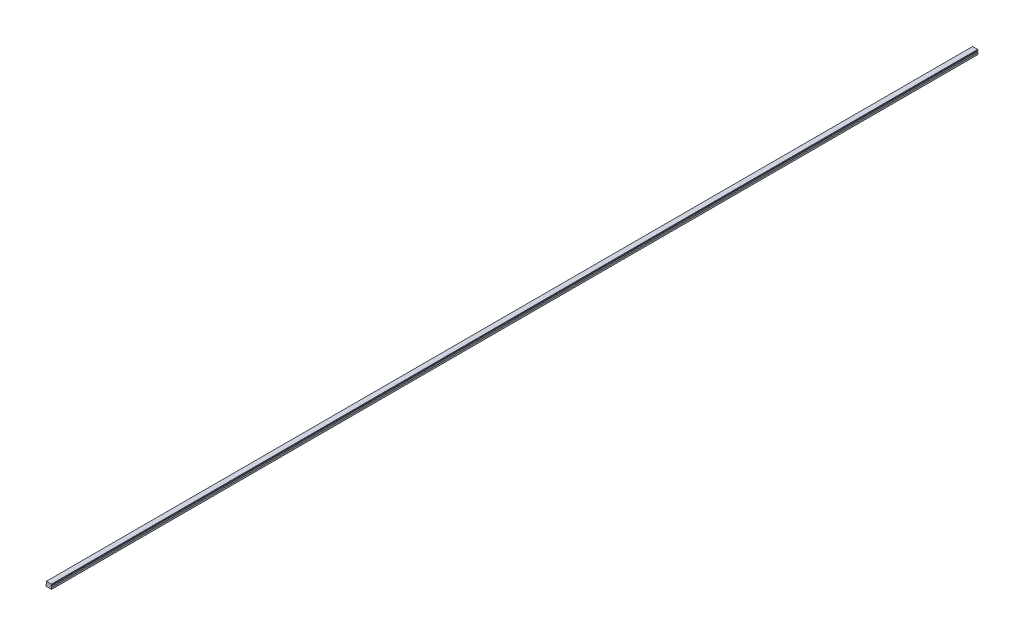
from build123d import *

# Parameters (mm, degrees)
SKETCH1_W           = 20
SKETCH1_H           = 16.3
BOSS_EXTRUDE1_DEPTH = 1640
CUT_EXTRUDE1_DEPTH  = 3281.055744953
CHAMFER1_SIZE       = 1
FILLET1_R           = 1
CUT_EXTRUDE2_DEPTH  = 3281.055744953
SKETCH5_R           = 3
SKETCH5_R_2         = 2.5
CUT_EXTRUDE5_DEPTH  = 10
SKETCH5_2_R         = 2.5
CUT_EXTRUDE6_DEPTH  = 13
LPATTERN2_COUNT     = 55
LPATTERN2_PITCH     = 60


with BuildPart() as part:
    # Sketch1 → Boss-Extrude1 (new, symmetric)
    with BuildSketch(Plane.XY):
        with Locations((0, 8.15)):
            Rectangle(SKETCH1_W, SKETCH1_H)
    extrude(amount=BOSS_EXTRUDE1_DEPTH, both=True)

    # Sketch2 → Cut-Extrude1 (cut, through all)
    with BuildSketch(Plane.XY.offset(1640)):
        Polygon((-10, 14.3), (-10, 7.3), (-7.666666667, 9.633333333), (-7.666666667, 11.966666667), align=None)
        Polygon((7.666666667, 11.966666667), (10, 14.3), (10, 7.3), (7.666666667, 9.633333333), align=None)
    extrude(amount=-CUT_EXTRUDE1_DEPTH, mode=Mode.SUBTRACT)

    # Chamfer1
    chamfer1_edges = [part.edges().sort_by_distance(p)[0] for p in [
        (-10, 16.3, 0),
        (10, 16.3, 0),
        (10, 0, 0),
        (-10, 0, 0),
    ]]
    chamfer(chamfer1_edges, length=CHAMFER1_SIZE)

    # Fillet1
    fillet1_edges = [part.edges().sort_by_distance(p)[0] for p in [
        (-7.666666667, 11.966666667, 0),
        (-7.666666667, 9.633333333, 0),
        (7.666666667, 9.633333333, 0),
        (7.666666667, 11.966666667, 0),
    ]]
    fillet(fillet1_edges, radius=FILLET1_R)

    # Sketch3 → Cut-Extrude2 (cut, through all)
    with BuildSketch(Plane.XY.offset(1640)):
        Polygon((-6, 0), (-5, 1), (5, 1), (6, 0), align=None)
    extrude(amount=-CUT_EXTRUDE2_DEPTH, mode=Mode.SUBTRACT)

    # Sketch5 → Cut-Extrude5 (cut)
    with BuildSketch(Plane.XZ.offset(-1)):
        with Locations(Location((0, 1620, 0), (0, 0, 270))):
            Circle(SKETCH5_R)
        with Locations(Location((0, 1620, 0), (0, 0, 270))):
            Circle(SKETCH5_R_2, mode=Mode.SUBTRACT)
    cut_extrude5 = extrude(amount=-CUT_EXTRUDE5_DEPTH, mode=Mode.SUBTRACT)

    # Sketch5_2 → Cut-Extrude6 (cut)
    with BuildSketch(Plane.XZ.offset(-1)):
        with Locations(Location((0, 1620, 0), (0, 0, 270))):
            Circle(SKETCH5_2_R)
    cut_extrude6 = extrude(amount=-CUT_EXTRUDE6_DEPTH, mode=Mode.SUBTRACT)

    # Cut-Extrude7 cone 1 section (on through the dimple's axis) → Cut-Extrude7 (revolve, cut)
    with BuildSketch(Plane(origin=(0, 14, 1620), x_dir=(0, 0, -1), z_dir=(1, 0, 0))):
        Polygon((0, 0), (2.5, 0), (0, 1.443375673), align=None)
    cut_extrude7 = revolve(axis=Axis((0, 14, 1620), (0, 1, 0)), mode=Mode.SUBTRACT)

    # LPattern2: Cut-Extrude5, Cut-Extrude6, Cut-Extrude7 ×55
    with Locations(*[(0, 0, -i * LPATTERN2_PITCH) for i in range(1, LPATTERN2_COUNT)]):
        add(cut_extrude5, mode=Mode.SUBTRACT)
        add(cut_extrude6, mode=Mode.SUBTRACT)
        add(cut_extrude7, mode=Mode.SUBTRACT)


solid = part.part
